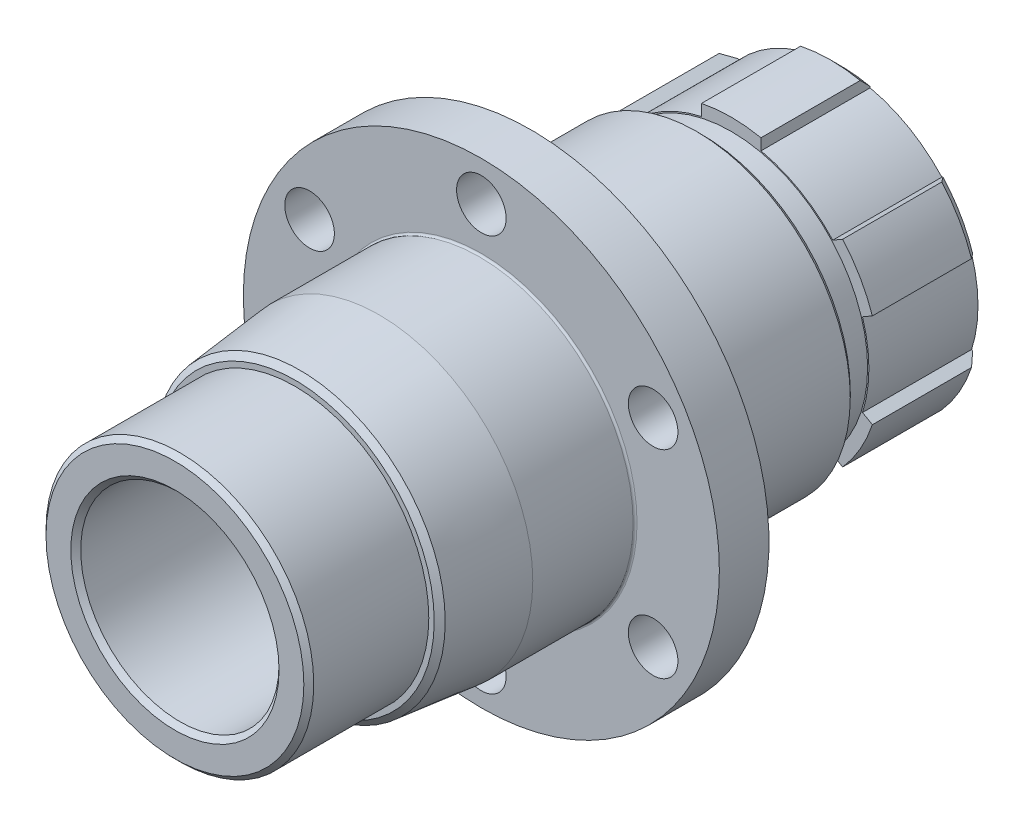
from build123d import *

# Parameters (mm, degrees)
SKETCH_1_R               = 15
EXTRUDE_1_DEPTH          = 14
SKETCH_2_OUTSIDE_W       = 40.936
SKETCH_2_OUTSIDE_H       = 40.936
SKETCH_2_OUTSIDE_R       = 13.75
CUT_EXTRUDE_1_DEPTH      = 3
SKETCH_3_R               = 15.5
EXTRUDE_2_DEPTH          = 11.5
SKETCH_4_R               = 16.5
EXTRUDE_4_DEPTH          = 29.5
CHAMFER_1_SIZE           = 18
CHAMFER_1_SIZE2          = 1.891876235
SKETCH_5_R               = 13.5
EXTRUDE_5_DEPTH          = 12.1
SKETCH_6_R               = 10
CUT_EXTRUDE_2_DEPTH      = 72.041607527
CUT_EXTRUDE_START        = -16.5
SKETCH_7_R               = 10.5
CUT_EXTRUDE_3_DEPTH      = 34.5
CHAMFER_2_SIZE           = 1
CHAMFER_3_SIZE           = 0.5
CHAMFER_4_SIZE           = 0.5
CHAMFER_5_SIZE           = 0.5
CHAMFER_6_SIZE           = 0.5
CHAMFER_6_SIZE2          = 0.561801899
CUT_EXTRUDE_4_DEPTH      = 11
PATTERN_CIRCULAR_1_COUNT = 6
SKETCH_9_R               = 33.5
SKETCH_9_R_2             = 16.5
EXTRUDE_6_DEPTH          = 5.7
CHAMFER_7_SIZE           = 1.5
CHAMFER_7_SIZE2          = 4.121216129
CUT_EXTRUDE_5_DEPTH      = 64.048076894
PATTERN_CIRCULAR_2_COUNT = 15
FILLET_1_R               = 1
CUT_EXTRUDE_START_2      = 1.2
SKETCH_11_R              = 22.5
SKETCH_11_R_2            = 16.5
CUT_EXTRUDE_6_DEPTH      = 1.2
FILLET_2_R               = 1
SKETCH_12_R              = 24
SKETCH_12_R_2            = 16.5
EXTRUDE_7_DEPTH          = 5
CUT_EXTRUDE_7_DEPTH      = 4
CUT_EXTRUDE_7_DEPTH_BACK = 5.7
SKETCH_13_OUTSIDE_W      = 92.066
SKETCH_13_OUTSIDE_H      = 91.744
SKETCH_13_OUTSIDE_R      = 15.5
FILLET_4_R               = 0.2
SKETCH_16_OUTSIDE_W      = 69.09
SKETCH_16_OUTSIDE_H      = 69.09
SKETCH_16_OUTSIDE_R      = 15.5
CUT_EXTRUDE_8_DEPTH      = 18.8
FILLET_5_R               = 0.2
HOLE_WIZARD_5_0_5_1_D    = 5
PATTERN_CIRCULAR_3_COUNT = 6


with BuildPart() as part:
    # Sketch 1 → Extrude 1 (new body)
    with BuildSketch(Plane.XY):
        Circle(SKETCH_1_R)
    extrude(amount=EXTRUDE_1_DEPTH)

    # Sketch 2 outside → Cut-Extrude 1 (cut)
    with BuildSketch(Plane.XY.offset(14)):
        Rectangle(SKETCH_2_OUTSIDE_W, SKETCH_2_OUTSIDE_H)
        Circle(SKETCH_2_OUTSIDE_R, mode=Mode.SUBTRACT)
    extrude(amount=-CUT_EXTRUDE_1_DEPTH, mode=Mode.SUBTRACT)

    # Sketch 3 → Extrude 2 (add)
    with BuildSketch(Plane.XY.offset(14)):
        Circle(SKETCH_3_R)
    extrude(amount=EXTRUDE_2_DEPTH)

    # Sketch 4 → Extrude 4 (add)
    with BuildSketch(Plane.XY.offset(25.5)):
        Circle(SKETCH_4_R)
    extrude(amount=EXTRUDE_4_DEPTH)

    # Chamfer 1
    chamfer_1_edges = [part.edges().sort_by_distance(p)[0] for p in [
        (-16.5, 0, 55),
    ]]
    chamfer_1_side = [part.faces().sort_by_distance(p)[0] for p in [
        (-16.5, 0, 40.25),
    ]]
    chamfer(chamfer_1_edges, length=CHAMFER_1_SIZE, length2=CHAMFER_1_SIZE2, reference=chamfer_1_side[0])

    # Sketch 5 → Extrude 5 (add)
    with BuildSketch(Plane.XY.offset(55)):
        Circle(SKETCH_5_R)
    extrude(amount=EXTRUDE_5_DEPTH)

    # Sketch 6 → Cut-Extrude 2 (cut, through all)
    with BuildSketch(Plane.XY.offset(67.1)):
        Circle(SKETCH_6_R)
    extrude(amount=-CUT_EXTRUDE_2_DEPTH, mode=Mode.SUBTRACT)

    # Sketch 7 → Cut-Extrude 3 (cut)
    with BuildSketch(Plane.XY.offset(67.1).offset(CUT_EXTRUDE_START)):
        Circle(SKETCH_7_R)
    extrude(amount=-CUT_EXTRUDE_3_DEPTH, mode=Mode.SUBTRACT)

    # Chamfer 2
    chamfer_2_edges = [part.edges().sort_by_distance(p)[0] for p in [
        (-15, 0, 0),
    ]]
    chamfer(chamfer_2_edges, length=CHAMFER_2_SIZE)

    # Chamfer 3
    chamfer_3_edges = [part.edges().sort_by_distance(p)[0] for p in [
        (-15.5, 0, 14),
    ]]
    chamfer(chamfer_3_edges, length=CHAMFER_3_SIZE)

    # Chamfer 4
    chamfer_4_edges = [part.edges().sort_by_distance(p)[0] for p in [
        (-10, 0, 0),
    ]]
    chamfer(chamfer_4_edges, length=CHAMFER_4_SIZE)

    # Chamfer 5
    chamfer_5_edges = [part.edges().sort_by_distance(p)[0] for p in [
        (-13.5, 0, 67.1),
        (-10, 0, 67.1),
    ]]
    chamfer(chamfer_5_edges, length=CHAMFER_5_SIZE)

    # Chamfer 6
    chamfer_6_edges = [part.edges().sort_by_distance(p)[0] for p in [
        (-14.608123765, 0, 55),
    ]]
    chamfer_6_side = [part.faces().sort_by_distance(p)[0] for p in [
        (-15.554061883, 0, 46),
    ]]
    chamfer(chamfer_6_edges, length=CHAMFER_6_SIZE, length2=CHAMFER_6_SIZE2, reference=chamfer_6_side[0])

    # Sketch 8 → Cut-Extrude 4 (cut)
    with BuildSketch(Plane(origin=(0, 0, 0), x_dir=(-1, 0, 0), z_dir=(0, 0, -1))):
        with BuildLine():
            Line((3, 19.376141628), (3, 13.551914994))
            ThreePointArc((3, 13.551914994), (6.94, 12.020432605), (10.236302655, 9.374033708))
            Line((10.236302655, 9.374033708), (14.451440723, 11.807644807))
            Line((14.451440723, 11.807644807), (3, 19.376141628))
        make_face()
    cut_extrude_4 = extrude(amount=-CUT_EXTRUDE_4_DEPTH, mode=Mode.SUBTRACT)

    # Pattern Circular 1: Cut-Extrude 4 ×6 about axis
    pattern_circular_1_axis = Axis((0, 0, 0), (0, 0, 1))
    for i in range(1, PATTERN_CIRCULAR_1_COUNT):
        add(cut_extrude_4.rotate(pattern_circular_1_axis, i * 360 / PATTERN_CIRCULAR_1_COUNT), mode=Mode.SUBTRACT)

    # Sketch 9 → Extrude 6 (add)
    with BuildSketch(Plane(origin=(0, 0, 25.5), x_dir=(-1, 0, 0), z_dir=(0, 0, -1))):
        Circle(SKETCH_9_R)
        Circle(SKETCH_9_R_2, mode=Mode.SUBTRACT)
    extrude(amount=-EXTRUDE_6_DEPTH)

    # Chamfer 7
    chamfer_7_edges = [part.edges().sort_by_distance(p)[0] for p in [
        (33.5, 0, 31.2),
        (33.5, 0, 25.5),
    ]]
    chamfer_7_side = [part.faces().sort_by_distance(p)[0] for p in [
        (33.5, 0, 28.35),
    ]]
    chamfer(chamfer_7_edges, length=CHAMFER_7_SIZE, length2=CHAMFER_7_SIZE2, reference=chamfer_7_side[0])

    # Sketch 10 → Cut-Extrude 5 (cut, through all)
    with BuildSketch(Plane(origin=(0, 0, 25.5), x_dir=(-1, 0, 0), z_dir=(0, 0, -1))):
        with BuildLine():
            Line((3.603130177, 29.047534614), (5.274339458, 33.082190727))
            ThreePointArc((5.274339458, 33.082190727), (0, 33.5), (-5.274339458, 33.082190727))
            Line((-5.274339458, 33.082190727), (-3.603130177, 29.047534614))
            ThreePointArc((-3.603130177, 29.047534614), (0, 26.64), (3.603130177, 29.047534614))
        make_face()
    cut_extrude_5 = extrude(amount=-CUT_EXTRUDE_5_DEPTH, mode=Mode.SUBTRACT)

    # Pattern Circular 2: Cut-Extrude 5 ×15 about axis
    pattern_circular_2_axis = Axis((0, 0, 0), (0, 0, 1))
    for i in range(1, PATTERN_CIRCULAR_2_COUNT):
        add(cut_extrude_5.rotate(pattern_circular_2_axis, i * 360 / PATTERN_CIRCULAR_2_COUNT), mode=Mode.SUBTRACT)

    # Fillet 1
    fillet_1_edges = [part.edges().sort_by_distance(p)[0] for p in [
        (-15.5, 0, 25.5),
    ]]
    fillet(fillet_1_edges, radius=FILLET_1_R)

    # Sketch 11 → Cut-Extrude 6 (cut)
    with BuildSketch(Plane(origin=(0, 0, 31.2), x_dir=(-1, 0, 0), z_dir=(0, 0, -1)).offset(CUT_EXTRUDE_START_2)):
        Circle(SKETCH_11_R)
        Circle(SKETCH_11_R_2, mode=Mode.SUBTRACT)
    extrude(amount=-CUT_EXTRUDE_6_DEPTH, mode=Mode.SUBTRACT)

    # Fillet 2
    fillet_2_edges = [part.edges().sort_by_distance(p)[0] for p in [
        (22.5, 0, 30),
        (16.5, 0, 30),
    ]]
    fillet(fillet_2_edges, radius=FILLET_2_R)

    # Sketch 12 → Extrude 7 (add)
    with BuildSketch(Plane.XY.offset(31.2)):
        with Locations(Location((0, 0, 0), (0, 0, 180))):
            Circle(SKETCH_12_R)
        Circle(SKETCH_12_R_2, mode=Mode.SUBTRACT)
    extrude(amount=EXTRUDE_7_DEPTH)

    # Sketch 13 outside → Cut-Extrude 7 (cut, two sides: drawn at the far end of the back side and taken through both)
    with BuildSketch(Plane(origin=(0, 0, 25.5), x_dir=(-1, 0, 0), z_dir=(0, 0, -1)).offset(-CUT_EXTRUDE_7_DEPTH_BACK)):
        with Locations((0, -0.209)):
            Rectangle(SKETCH_13_OUTSIDE_W, SKETCH_13_OUTSIDE_H)
        Circle(SKETCH_13_OUTSIDE_R, mode=Mode.SUBTRACT)
    extrude(amount=CUT_EXTRUDE_7_DEPTH + CUT_EXTRUDE_7_DEPTH_BACK, mode=Mode.SUBTRACT)

    # Fillet 4
    fillet_4_edges = [part.edges().sort_by_distance(p)[0] for p in [
        (15.5, 0, 31.2),
    ]]
    fillet(fillet_4_edges, radius=FILLET_4_R)

    # Sketch 16 outside → Cut-Extrude 8 (cut)
    with BuildSketch(Plane.XY.offset(55)):
        Rectangle(SKETCH_16_OUTSIDE_W, SKETCH_16_OUTSIDE_H)
        Circle(SKETCH_16_OUTSIDE_R, mode=Mode.SUBTRACT)
    extrude(amount=-CUT_EXTRUDE_8_DEPTH, mode=Mode.SUBTRACT)

    # Fillet 5
    fillet_5_edges = [part.edges().sort_by_distance(p)[0] for p in [
        (-15.5, 0, 36.2),
    ]]
    fillet(fillet_5_edges, radius=FILLET_5_R)

    # Hole Wizard 5.0 _5_ _1 (through all)
    with Locations(Plane.XY.offset(36.2)):
        with Locations((0, 20)):
            hole_wizard_5_0_5_1 = Hole(HOLE_WIZARD_5_0_5_1_D / 2)

    # Pattern Circular 3: Hole Wizard 5.0 _5_ _1 ×6 about axis
    pattern_circular_3_axis = Axis((0, 0, 0), (0, 0, 1))
    for i in range(1, PATTERN_CIRCULAR_3_COUNT):
        add(hole_wizard_5_0_5_1.rotate(pattern_circular_3_axis, i * 360 / PATTERN_CIRCULAR_3_COUNT), mode=Mode.SUBTRACT)


solid = part.part
